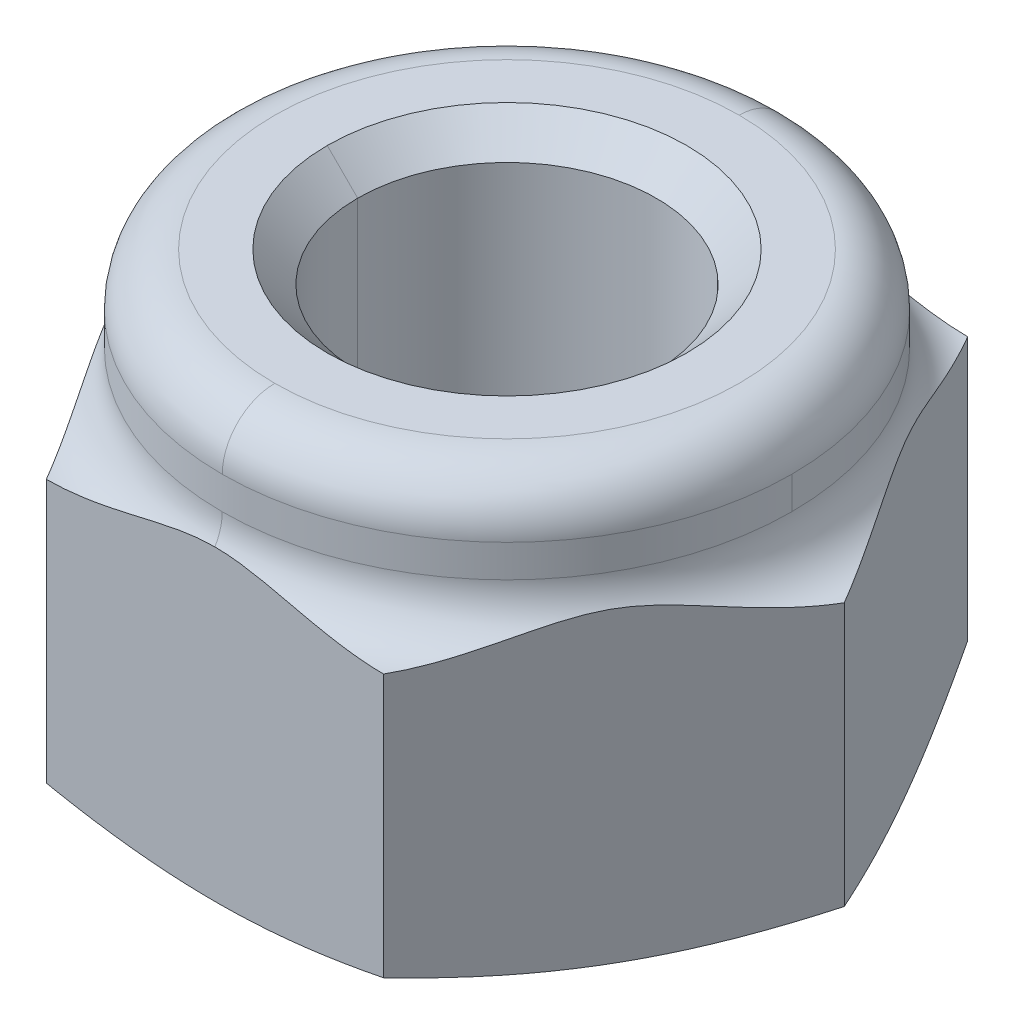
ISO-10303-21;
HEADER;
FILE_DESCRIPTION(('STEP AP214'),'2;1');
FILE_NAME('part.step','',(''),(''),'','','');
FILE_SCHEMA(('AUTOMOTIVE_DESIGN { 1 0 10303 214 1 1 1 1 }'));
ENDSEC;
DATA;
#1=APPLICATION_CONTEXT('core data for automotive mechanical design processes');
#2=APPLICATION_PROTOCOL_DEFINITION('international standard','automotive_design',2000,#1);
#3=PRODUCT_CONTEXT('',#1,'mechanical');
#4=PRODUCT('Part','Part','',(#3));
#5=PRODUCT_RELATED_PRODUCT_CATEGORY('part','',(#4));
#6=PRODUCT_DEFINITION_FORMATION('','',#4);
#7=PRODUCT_DEFINITION_CONTEXT('part definition',#1,'design');
#8=PRODUCT_DEFINITION('design','',#6,#7);
#9=PRODUCT_DEFINITION_SHAPE('','',#8);
#10=(LENGTH_UNIT() NAMED_UNIT(*) SI_UNIT(.MILLI.,.METRE.));
#11=(NAMED_UNIT(*) PLANE_ANGLE_UNIT() SI_UNIT($,.RADIAN.));
#12=(NAMED_UNIT(*) SI_UNIT($,.STERADIAN.) SOLID_ANGLE_UNIT());
#13=UNCERTAINTY_MEASURE_WITH_UNIT(LENGTH_MEASURE(1.E-05),#10,'distance_accuracy_value','');
#14=(GEOMETRIC_REPRESENTATION_CONTEXT(3) GLOBAL_UNCERTAINTY_ASSIGNED_CONTEXT((#13)) GLOBAL_UNIT_ASSIGNED_CONTEXT((#10,
#11,#12)) REPRESENTATION_CONTEXT('',''));
#15=CARTESIAN_POINT('',(0.,0.,0.));
#16=DIRECTION('',(0.,0.,1.));
#17=DIRECTION('',(1.,0.,0.));
#18=AXIS2_PLACEMENT_3D('',#15,#16,#17);
#19=CARTESIAN_POINT('',(0.,0.33828125,0.));
#20=DIRECTION('',(0.,-1.,0.));
#21=DIRECTION('',(1.,0.,0.));
#22=AXIS2_PLACEMENT_3D('',#19,#20,#21);
#23=CONICAL_SURFACE('',#22,3.66171875,0.785398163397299);
#24=CARTESIAN_POINT('',(0.,0.,0.));
#25=DIRECTION('',(0.,1.,0.));
#26=DIRECTION('',(-1.,0.,0.));
#27=AXIS2_PLACEMENT_3D('',#24,#25,#26);
#28=CIRCLE('',#27,4.);
#29=CARTESIAN_POINT('',(-4.,0.,0.));
#30=VERTEX_POINT('',#29);
#31=CARTESIAN_POINT('',(4.,0.,0.));
#32=VERTEX_POINT('',#31);
#33=EDGE_CURVE('E257',#30,#32,#28,.T.);
#34=ORIENTED_EDGE('',*,*,#33,.F.);
#35=DIRECTION('',(0.707106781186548,0.707106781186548,0.));
#36=VECTOR('',#35,1.);
#37=CARTESIAN_POINT('',(-4.,0.,0.));
#38=LINE('',#37,#36);
#39=CARTESIAN_POINT('',(-3.3234375,0.6765625,0.));
#40=VERTEX_POINT('',#39);
#41=EDGE_CURVE('E27',#30,#40,#38,.T.);
#42=ORIENTED_EDGE('',*,*,#41,.T.);
#43=CARTESIAN_POINT('',(0.,0.6765625,0.));
#44=DIRECTION('',(0.,1.,0.));
#45=DIRECTION('',(-1.,0.,0.));
#46=AXIS2_PLACEMENT_3D('',#43,#44,#45);
#47=CIRCLE('',#46,3.3234375);
#48=CARTESIAN_POINT('',(3.3234375,0.6765625,0.));
#49=VERTEX_POINT('',#48);
#50=EDGE_CURVE('E554',#40,#49,#47,.T.);
#51=ORIENTED_EDGE('',*,*,#50,.T.);
#52=DIRECTION('',(0.707106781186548,-0.707106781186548,0.));
#53=VECTOR('',#52,1.);
#54=CARTESIAN_POINT('',(3.3234375,0.6765625,0.));
#55=LINE('',#54,#53);
#56=EDGE_CURVE('E11',#49,#32,#55,.T.);
#57=ORIENTED_EDGE('',*,*,#56,.T.);
#58=EDGE_LOOP('',(#34,#42,#51,#57));
#59=FACE_BOUND('',#58,.T.);
#60=ADVANCED_FACE('F16',(#59),#23,.F.);
#61=CARTESIAN_POINT('',(0.,0.33828125,0.));
#62=DIRECTION('',(0.,-1.,0.));
#63=DIRECTION('',(1.,0.,0.));
#64=AXIS2_PLACEMENT_3D('',#61,#62,#63);
#65=CONICAL_SURFACE('',#64,3.66171875,0.785398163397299);
#66=CARTESIAN_POINT('',(0.,0.6765625,0.));
#67=DIRECTION('',(0.,1.,0.));
#68=DIRECTION('',(1.,0.,0.));
#69=AXIS2_PLACEMENT_3D('',#66,#67,#68);
#70=CIRCLE('',#69,3.3234375);
#71=EDGE_CURVE('E542',#49,#40,#70,.T.);
#72=ORIENTED_EDGE('',*,*,#71,.T.);
#73=ORIENTED_EDGE('',*,*,#41,.F.);
#74=CARTESIAN_POINT('',(0.,0.,0.));
#75=DIRECTION('',(0.,1.,0.));
#76=DIRECTION('',(1.,0.,0.));
#77=AXIS2_PLACEMENT_3D('',#74,#75,#76);
#78=CIRCLE('',#77,4.);
#79=EDGE_CURVE('E225',#32,#30,#78,.T.);
#80=ORIENTED_EDGE('',*,*,#79,.F.);
#81=ORIENTED_EDGE('',*,*,#56,.F.);
#82=EDGE_LOOP('',(#72,#73,#80,#81));
#83=FACE_BOUND('',#82,.T.);
#84=ADVANCED_FACE('F518',(#83),#65,.F.);
#85=CARTESIAN_POINT('',(0.,0.,0.));
#86=DIRECTION('',(0.,1.,0.));
#87=DIRECTION('',(1.,0.,0.));
#88=AXIS2_PLACEMENT_3D('',#85,#86,#87);
#89=PLANE('',#88);
#90=ORIENTED_EDGE('',*,*,#79,.T.);
#91=ORIENTED_EDGE('',*,*,#33,.T.);
#92=EDGE_LOOP('',(#90,#91));
#93=FACE_BOUND('',#92,.T.);
#94=CARTESIAN_POINT('',(0.,0.,0.));
#95=DIRECTION('',(0.,-1.,0.));
#96=DIRECTION('',(1.,0.,0.));
#97=AXIS2_PLACEMENT_3D('',#94,#95,#96);
#98=CIRCLE('',#97,6.056499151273);
#99=CARTESIAN_POINT('',(6.056499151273,0.,0.));
#100=VERTEX_POINT('',#99);
#101=CARTESIAN_POINT('',(-6.056499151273,0.,0.));
#102=VERTEX_POINT('',#101);
#103=EDGE_CURVE('E252',#100,#102,#98,.T.);
#104=ORIENTED_EDGE('',*,*,#103,.T.);
#105=CARTESIAN_POINT('',(0.,0.,0.));
#106=DIRECTION('',(0.,-1.,0.));
#107=DIRECTION('',(-1.,0.,0.));
#108=AXIS2_PLACEMENT_3D('',#105,#106,#107);
#109=CIRCLE('',#108,6.056499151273);
#110=EDGE_CURVE('E222',#102,#100,#109,.T.);
#111=ORIENTED_EDGE('',*,*,#110,.T.);
#112=EDGE_LOOP('',(#104,#111));
#113=FACE_BOUND('',#112,.T.);
#114=ADVANCED_FACE('F516',(#93,#113),#89,.F.);
#115=CARTESIAN_POINT('',(0.,0.2927272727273,0.));
#116=DIRECTION('',(0.,1.,0.));
#117=DIRECTION('',(1.,0.,0.));
#118=AXIS2_PLACEMENT_3D('',#115,#116,#117);
#119=CONICAL_SURFACE('',#118,6.781024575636,1.18682389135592);
#120=ORIENTED_EDGE('',*,*,#110,.F.);
#121=DIRECTION('',(-0.927183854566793,0.374606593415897,0.));
#122=VECTOR('',#121,1.);
#123=CARTESIAN_POINT('',(-6.056499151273,0.,0.));
#124=LINE('',#123,#122);
#125=CARTESIAN_POINT('',(-7.50555,0.5854545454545,0.));
#126=VERTEX_POINT('',#125);
#127=EDGE_CURVE('E256',#102,#126,#124,.T.);
#128=ORIENTED_EDGE('',*,*,#127,.T.);
#129=CARTESIAN_POINT('',(-7.50554999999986,0.585454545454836,0.));
#130=CARTESIAN_POINT('',(-7.44919035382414,0.562684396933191,-0.0976157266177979));
#131=CARTESIAN_POINT('',(-7.3927394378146,0.54064550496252,-0.195351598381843));
#132=CARTESIAN_POINT('',(-7.28060472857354,0.498508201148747,-0.389474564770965));
#133=CARTESIAN_POINT('',(-7.22492351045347,0.478383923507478,-0.485857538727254));
#134=CARTESIAN_POINT('',(-7.11422124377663,0.440073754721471,-0.677512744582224));
#135=CARTESIAN_POINT('',(-7.05920203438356,0.421864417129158,-0.772781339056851));
#136=CARTESIAN_POINT('',(-6.94968833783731,0.387380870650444,-0.962457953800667));
#137=CARTESIAN_POINT('',(-6.89519518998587,0.371086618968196,-1.05686309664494));
#138=CARTESIAN_POINT('',(-6.7865753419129,0.340432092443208,-1.24508044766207));
#139=CARTESIAN_POINT('',(-6.73244958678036,0.326056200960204,-1.3388906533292));
#140=CARTESIAN_POINT('',(-6.62434502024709,0.299224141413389,-1.52617771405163));
#141=CARTESIAN_POINT('',(-6.57036701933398,0.28675792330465,-1.61965359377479));
#142=CARTESIAN_POINT('',(-6.4659577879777,0.26453229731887,-1.80043529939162));
#143=CARTESIAN_POINT('',(-6.41553410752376,0.254646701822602,-1.88772994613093));
#144=CARTESIAN_POINT('',(-6.31486148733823,0.236684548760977,-2.06215068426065));
#145=CARTESIAN_POINT('',(-6.26461263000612,0.228601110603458,-2.14927611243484));
#146=CARTESIAN_POINT('',(-6.16405737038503,0.214230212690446,-2.32364385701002));
#147=CARTESIAN_POINT('',(-6.11375096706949,0.207942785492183,-2.41088617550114));
#148=CARTESIAN_POINT('',(-6.01055348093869,0.196910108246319,-2.58967924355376));
#149=CARTESIAN_POINT('',(-5.95765629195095,0.19225529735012,-2.68123207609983));
#150=CARTESIAN_POINT('',(-5.85217740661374,0.185026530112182,-2.86375778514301));
#151=CARTESIAN_POINT('',(-5.79959605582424,0.182438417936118,-2.9547302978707));
#152=CARTESIAN_POINT('',(-5.69455965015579,0.179340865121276,-3.13655244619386));
#153=CARTESIAN_POINT('',(-5.64210454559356,0.178827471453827,-3.22740198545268));
#154=CARTESIAN_POINT('',(-5.53961253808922,0.179823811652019,-3.40488290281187));
#155=CARTESIAN_POINT('',(-5.48957600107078,0.181241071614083,-3.49151503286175));
#156=CARTESIAN_POINT('',(-5.38958058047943,0.185929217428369,-3.66464451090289));
#157=CARTESIAN_POINT('',(-5.33962167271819,0.189198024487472,-3.75114190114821));
#158=CARTESIAN_POINT('',(-5.23959210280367,0.19758491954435,-3.92437062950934));
#159=CARTESIAN_POINT('',(-5.18952162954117,0.202709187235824,-4.01110177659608));
#160=CARTESIAN_POINT('',(-5.08934627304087,0.214762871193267,-4.18459815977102));
#161=CARTESIAN_POINT('',(-5.03924145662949,0.221695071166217,-4.27136324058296));
#162=CARTESIAN_POINT('',(-4.93893367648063,0.237354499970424,-4.44511237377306));
#163=CARTESIAN_POINT('',(-4.88873105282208,0.246088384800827,-4.53209602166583));
#164=CARTESIAN_POINT('',(-4.7880461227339,0.265345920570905,-4.70659512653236));
#165=CARTESIAN_POINT('',(-4.73756460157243,0.275882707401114,-4.79410958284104));
#166=CARTESIAN_POINT('',(-4.63610015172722,0.298728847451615,-4.96992487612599));
#167=CARTESIAN_POINT('',(-4.58511785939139,0.311056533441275,-5.05822369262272));
#168=CARTESIAN_POINT('',(-4.48293830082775,0.337403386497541,-5.23515707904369));
#169=CARTESIAN_POINT('',(-4.43174156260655,0.35143219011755,-5.3237905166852));
#170=CARTESIAN_POINT('',(-4.32902275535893,0.381179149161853,-5.50164917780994));
#171=CARTESIAN_POINT('',(-4.27750179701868,0.39691110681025,-5.59087273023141));
#172=CARTESIAN_POINT('',(-4.17400991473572,0.430059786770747,-5.77013694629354));
#173=CARTESIAN_POINT('',(-4.12204055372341,0.447493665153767,-5.86017533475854));
#174=CARTESIAN_POINT('',(-4.01752735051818,0.484043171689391,-6.04127038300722));
#175=CARTESIAN_POINT('',(-3.96498537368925,0.503178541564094,-6.13232412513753));
#176=CARTESIAN_POINT('',(-3.85920143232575,0.5431290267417,-6.315627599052));
#177=CARTESIAN_POINT('',(-3.80596138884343,0.563965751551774,-6.40787373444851));
#178=CARTESIAN_POINT('',(-3.75277499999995,0.585454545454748,-6.49999696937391));
#179=B_SPLINE_CURVE_WITH_KNOTS('',3,(#129,#130,#131,#132,#133,#134,#135,#136,#137,#138,#139,
#140,#141,#142,#143,#144,#145,#146,#147,#148,#149,#150,#151,#152,#153,#154,#155,#156,#157,#158,
#159,#160,#161,#162,#163,#164,#165,#166,#167,#168,#169,#170,#171,#172,#173,#174,#175,#176,#177,
#178),.UNSPECIFIED.,.F.,.F.,(4,2,2,2,2,2,2,2,2,2,2,2,2,2,2,2,2,2,2,2,2,2,2,2,4),(0.,
0.344983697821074,0.684318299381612,1.01883950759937,1.3494701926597,1.67721951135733,
2.00317989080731,2.30704942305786,2.60973812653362,2.9124323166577,3.22992714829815,
3.5452281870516,3.85992818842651,4.16007292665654,4.45988134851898,4.76069762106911,
5.06197982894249,5.36439566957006,5.6691168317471,5.97721159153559,6.28714124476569,
6.59980307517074,6.91602790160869,7.23657815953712,7.56214745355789),.UNSPECIFIED.);
#180=CARTESIAN_POINT('',(-3.752775,0.5854545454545,-6.499996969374));
#181=VERTEX_POINT('',#180);
#182=EDGE_CURVE('E397',#126,#181,#179,.T.);
#183=ORIENTED_EDGE('',*,*,#182,.T.);
#184=CARTESIAN_POINT('',(-3.75277499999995,0.585454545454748,-6.49999696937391));
#185=CARTESIAN_POINT('',(-3.6400574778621,0.562684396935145,-6.49999594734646));
#186=CARTESIAN_POINT('',(-3.52719027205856,0.540645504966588,-6.49997595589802));
#187=CARTESIAN_POINT('',(-3.30300749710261,0.498508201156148,-6.49992593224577));
#188=CARTESIAN_POINT('',(-3.19169678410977,0.478383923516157,-6.49989606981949));
#189=CARTESIAN_POINT('',(-2.97036737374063,0.440073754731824,-6.49985269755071));
#190=CARTESIAN_POINT('',(-2.8603527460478,0.421864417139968,-6.49983896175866));
#191=CARTESIAN_POINT('',(-2.64133113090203,0.387380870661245,-6.49983562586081));
#192=CARTESIAN_POINT('',(-2.53232730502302,0.371086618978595,-6.49984574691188));
#193=CARTESIAN_POINT('',(-2.3150163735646,0.340432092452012,-6.49988687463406));
#194=CARTESIAN_POINT('',(-2.20671147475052,0.326056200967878,-6.49991769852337));
#195=CARTESIAN_POINT('',(-1.99046383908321,0.29922414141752,-6.49993992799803));
#196=CARTESIAN_POINT('',(-1.88252235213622,0.28675792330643,-6.49993154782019));
#197=CARTESIAN_POINT('',(-1.67375618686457,0.264532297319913,-6.49990135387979));
#198=CARTESIAN_POINT('',(-1.57294496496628,0.25464670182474,-6.49988048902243));
#199=CARTESIAN_POINT('',(-1.37155586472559,0.236684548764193,-6.49990581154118));
#200=CARTESIAN_POINT('',(-1.270978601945,0.228601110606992,-6.49995173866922));
#201=CARTESIAN_POINT('',(-1.06969407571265,0.214230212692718,-6.50005220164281));
#202=CARTESIAN_POINT('',(-0.968986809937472,0.207942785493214,-6.5001067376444));
#203=CARTESIAN_POINT('',(-0.762548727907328,0.196910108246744,-6.50013162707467));
#204=CARTESIAN_POINT('',(-0.656813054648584,0.192255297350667,-6.50009773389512));
#205=CARTESIAN_POINT('',(-0.446001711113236,0.185026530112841,-6.50001319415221));
#206=CARTESIAN_POINT('',(-0.340926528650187,0.182438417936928,-6.49996266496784));
#207=CARTESIAN_POINT('',(-0.130945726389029,0.179340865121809,-6.49990954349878));
#208=CARTESIAN_POINT('',(-0.0260401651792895,0.178827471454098,-6.49990686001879));
#209=CARTESIAN_POINT('',(0.178908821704,0.179823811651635,-6.49988663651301));
#210=CARTESIAN_POINT('',(0.278952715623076,0.181241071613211,-6.49986978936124));
#211=CARTESIAN_POINT('',(0.478884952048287,0.185929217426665,-6.49983595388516));
#212=CARTESIAN_POINT('',(0.578773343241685,0.189198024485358,-6.4998189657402));
#213=CARTESIAN_POINT('',(0.778808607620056,0.197584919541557,-6.49980518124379));
#214=CARTESIAN_POINT('',(0.878955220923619,0.2027091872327,-6.49980845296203));
#215=CARTESIAN_POINT('',(1.07929517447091,0.214762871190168,-6.49980224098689));
#216=CARTESIAN_POINT('',(1.17948834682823,0.221695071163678,-6.49979273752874));
#217=CARTESIAN_POINT('',(1.38011340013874,0.237354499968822,-6.499798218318));
#218=CARTESIAN_POINT('',(1.48054476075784,0.246088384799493,-6.49981329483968));
#219=CARTESIAN_POINT('',(1.68200788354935,0.265345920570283,-6.49986714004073));
#220=CARTESIAN_POINT('',(1.78303838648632,0.275882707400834,-6.49990608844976));
#221=CARTESIAN_POINT('',(1.98603112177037,0.298728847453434,-6.49994294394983));
#222=CARTESIAN_POINT('',(2.08799128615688,0.31105653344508,-6.49994039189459));
#223=CARTESIAN_POINT('',(2.29230987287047,0.337403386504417,-6.49991699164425));
#224=CARTESIAN_POINT('',(2.39466705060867,0.35143219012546,-6.49989603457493));
#225=CARTESIAN_POINT('',(2.60005657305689,0.381179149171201,-6.49986826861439));
#226=CARTESIAN_POINT('',(2.70308691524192,0.396911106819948,-6.4998615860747));
#227=CARTESIAN_POINT('',(2.91008022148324,0.430059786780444,-6.49986709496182));
#228=CARTESIAN_POINT('',(3.01404043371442,0.447493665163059,-6.49987950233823));
#229=CARTESIAN_POINT('',(3.22312994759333,0.484043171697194,-6.49991593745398));
#230=CARTESIAN_POINT('',(3.32825578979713,0.503178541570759,-6.49994012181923));
#231=CARTESIAN_POINT('',(3.53989322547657,0.543129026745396,-6.49998027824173));
#232=CARTESIAN_POINT('',(3.64640074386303,0.563965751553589,-6.49999611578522));
#233=CARTESIAN_POINT('',(3.75277499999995,0.585454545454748,-6.49999696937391));
#234=B_SPLINE_CURVE_WITH_KNOTS('',3,(#184,#185,#186,#187,#188,#189,#190,#191,#192,#193,#194,
#195,#196,#197,#198,#199,#200,#201,#202,#203,#204,#205,#206,#207,#208,#209,#210,#211,#212,#213,
#214,#215,#216,#217,#218,#219,#220,#221,#222,#223,#224,#225,#226,#227,#228,#229,#230,#231,#232,
#233),.UNSPECIFIED.,.F.,.F.,(4,2,2,2,2,2,2,2,2,2,2,2,2,2,2,2,2,2,2,2,2,2,2,2,4),(0.,
0.344983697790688,0.684318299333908,1.01883950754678,1.34947019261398,1.67721951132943,
2.00317989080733,2.3070494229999,2.60973812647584,2.91243231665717,3.2299271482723,
3.5452281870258,3.85992818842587,4.16007292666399,4.4598813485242,4.7606976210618,
5.06197982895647,5.36439566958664,5.66911683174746,5.97721159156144,6.28714124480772,
6.59980307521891,6.9160279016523,7.23657815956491,7.56214745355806),.UNSPECIFIED.);
#235=CARTESIAN_POINT('',(3.752775,0.5854545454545,-6.499996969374));
#236=VERTEX_POINT('',#235);
#237=EDGE_CURVE('E1104',#181,#236,#234,.T.);
#238=ORIENTED_EDGE('',*,*,#237,.T.);
#239=CARTESIAN_POINT('',(3.75277499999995,0.585454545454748,-6.49999696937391));
#240=CARTESIAN_POINT('',(3.80913287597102,0.56268439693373,-6.40238022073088));
#241=CARTESIAN_POINT('',(3.86554916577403,0.540645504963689,-6.3046243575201));
#242=CARTESIAN_POINT('',(3.97759723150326,0.49850820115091,-6.11045136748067));
#243=CARTESIAN_POINT('',(4.03322672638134,0.478383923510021,-6.01403853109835));
#244=CARTESIAN_POINT('',(4.14385387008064,0.440073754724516,-5.82233995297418));
#245=CARTESIAN_POINT('',(4.19884928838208,0.421864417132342,-5.72705762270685));
#246=CARTESIAN_POINT('',(4.30835720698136,0.387380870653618,-5.53737767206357));
#247=CARTESIAN_POINT('',(4.36286788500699,0.371086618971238,-5.44298265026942));
#248=CARTESIAN_POINT('',(4.47155896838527,0.340432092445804,-5.25480642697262));
#249=CARTESIAN_POINT('',(4.52573811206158,0.326056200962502,-5.1610270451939));
#250=CARTESIAN_POINT('',(4.63388118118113,0.299224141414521,-4.97376221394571));
#251=CARTESIAN_POINT('',(4.68784466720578,0.28675792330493,-4.88027795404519));
#252=CARTESIAN_POINT('',(4.79220160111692,0.264532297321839,-4.69946605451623));
#253=CARTESIAN_POINT('',(4.8425891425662,0.254646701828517,-4.61215054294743));
#254=CARTESIAN_POINT('',(4.9433056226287,0.236684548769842,-4.43775512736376));
#255=CARTESIAN_POINT('',(4.9936340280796,0.228601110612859,-4.350675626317));
#256=CARTESIAN_POINT('',(5.09436329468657,0.214230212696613,-4.17640834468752));
#257=CARTESIAN_POINT('',(5.14476415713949,0.207942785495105,-4.08922056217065));
#258=CARTESIAN_POINT('',(5.24800475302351,0.196910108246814,-3.91045238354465));
#259=CARTESIAN_POINT('',(5.30084323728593,0.192255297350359,-3.8188656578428));
#260=CARTESIAN_POINT('',(5.40617569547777,0.185026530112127,-3.63625540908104));
#261=CARTESIAN_POINT('',(5.45866952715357,0.182438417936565,-3.54523236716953));
#262=CARTESIAN_POINT('',(5.56361392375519,0.179340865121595,-3.36335709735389));
#263=CARTESIAN_POINT('',(5.61606438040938,0.178827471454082,-3.27250487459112));
#264=CARTESIAN_POINT('',(5.71852135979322,0.179823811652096,-3.09500373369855));
#265=CARTESIAN_POINT('',(5.76852871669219,0.181241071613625,-3.00835475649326));
#266=CARTESIAN_POINT('',(5.86846553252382,0.185929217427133,-2.83519144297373));
#267=CARTESIAN_POINT('',(5.91839501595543,0.189198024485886,-2.74867706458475));
#268=CARTESIAN_POINT('',(6.01840071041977,0.197584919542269,-2.57543455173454));
#269=CARTESIAN_POINT('',(6.0684768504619,0.202709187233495,-2.48870667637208));
#270=CARTESIAN_POINT('',(6.16864144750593,0.214762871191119,-2.31520408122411));
#271=CARTESIAN_POINT('',(6.21872980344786,0.221695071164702,-2.22842949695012));
#272=CARTESIAN_POINT('',(6.31904707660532,0.237354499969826,-2.0546858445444));
#273=CARTESIAN_POINT('',(6.36927581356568,0.246088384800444,-1.96771727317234));
#274=CARTESIAN_POINT('',(6.47005400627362,0.265345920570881,-1.79327201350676));
#275=CARTESIAN_POINT('',(6.52060298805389,0.275882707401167,-1.70579650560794));
#276=CARTESIAN_POINT('',(6.62213127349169,0.298728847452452,-1.53001806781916));
#277=CARTESIAN_POINT('',(6.67310914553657,0.311056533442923,-1.44171669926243));
#278=CARTESIAN_POINT('',(6.77524817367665,0.337403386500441,-1.26475991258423));
#279=CARTESIAN_POINT('',(6.82640861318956,0.351432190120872,-1.17610551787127));
#280=CARTESIAN_POINT('',(6.92907932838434,0.381179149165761,-0.998219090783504));
#281=CARTESIAN_POINT('',(6.98058871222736,0.396911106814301,-0.908988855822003));
#282=CARTESIAN_POINT('',(7.08409013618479,0.430059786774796,-0.729730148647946));
#283=CARTESIAN_POINT('',(7.1360809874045,0.447493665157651,-0.639704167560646));
#284=CARTESIAN_POINT('',(7.24065729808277,0.484043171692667,-0.458645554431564));
#285=CARTESIAN_POINT('',(7.2932411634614,0.503178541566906,-0.367615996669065));
#286=CARTESIAN_POINT('',(7.3990946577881,0.543129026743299,-0.18435267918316));
#287=CARTESIAN_POINT('',(7.45236213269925,0.563965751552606,-0.0921223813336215));
#288=CARTESIAN_POINT('',(7.50554999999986,0.585454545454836,0.));
#289=B_SPLINE_CURVE_WITH_KNOTS('',3,(#239,#240,#241,#242,#243,#244,#245,#246,#247,#248,#249,
#250,#251,#252,#253,#254,#255,#256,#257,#258,#259,#260,#261,#262,#263,#264,#265,#266,#267,#268,
#269,#270,#271,#272,#273,#274,#275,#276,#277,#278,#279,#280,#281,#282,#283,#284,#285,#286,#287,
#288),.UNSPECIFIED.,.F.,.F.,(4,2,2,2,2,2,2,2,2,2,2,2,2,2,2,2,2,2,2,2,2,2,2,2,4),(0.,
0.344983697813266,0.684318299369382,1.01883950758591,1.34947019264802,1.67721951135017,
2.00317989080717,2.30704942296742,2.60973812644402,2.91243231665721,3.22992714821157,
3.54522818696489,3.85992818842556,4.16007292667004,4.45988134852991,4.76069762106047,
5.06197982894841,5.36439566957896,5.66911683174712,5.97721159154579,6.28714124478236,
6.59980307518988,6.91602790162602,7.23657815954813,7.56214745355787),.UNSPECIFIED.);
#290=CARTESIAN_POINT('',(7.50555,0.5854545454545,0.));
#291=VERTEX_POINT('',#290);
#292=EDGE_CURVE('E513',#236,#291,#289,.T.);
#293=ORIENTED_EDGE('',*,*,#292,.T.);
#294=DIRECTION('',(-0.927183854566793,-0.374606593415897,0.));
#295=VECTOR('',#294,1.);
#296=CARTESIAN_POINT('',(7.50555,0.5854545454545,0.));
#297=LINE('',#296,#295);
#298=EDGE_CURVE('E226',#291,#100,#297,.T.);
#299=ORIENTED_EDGE('',*,*,#298,.T.);
#300=EDGE_LOOP('',(#120,#128,#183,#238,#293,#299));
#301=FACE_BOUND('',#300,.T.);
#302=ADVANCED_FACE('F285',(#301),#119,.T.);
#303=CARTESIAN_POINT('',(0.,0.2927272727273,0.));
#304=DIRECTION('',(0.,1.,0.));
#305=DIRECTION('',(1.,0.,0.));
#306=AXIS2_PLACEMENT_3D('',#303,#304,#305);
#307=CONICAL_SURFACE('',#306,6.781024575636,1.18682389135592);
#308=CARTESIAN_POINT('',(7.50554999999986,0.585454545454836,0.));
#309=CARTESIAN_POINT('',(7.44919035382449,0.562684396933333,0.0976157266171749));
#310=CARTESIAN_POINT('',(7.39273943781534,0.54064550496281,0.195351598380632));
#311=CARTESIAN_POINT('',(7.28060472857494,0.498508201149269,0.389474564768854));
#312=CARTESIAN_POINT('',(7.22492351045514,0.478383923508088,0.485857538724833));
#313=CARTESIAN_POINT('',(7.11422124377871,0.440073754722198,0.677512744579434));
#314=CARTESIAN_POINT('',(7.05920203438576,0.421864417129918,0.772781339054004));
#315=CARTESIAN_POINT('',(6.94968833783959,0.387380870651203,0.962457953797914));
#316=CARTESIAN_POINT('',(6.8951951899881,0.371086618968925,1.05686309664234));
#317=CARTESIAN_POINT('',(6.78657534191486,0.340432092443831,1.24508044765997));
#318=CARTESIAN_POINT('',(6.7324495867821,0.326056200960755,1.33889065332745));
#319=CARTESIAN_POINT('',(6.62434502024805,0.299224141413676,1.52617771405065));
#320=CARTESIAN_POINT('',(6.57036701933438,0.286757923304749,1.61965359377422));
#321=CARTESIAN_POINT('',(6.46595778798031,0.264532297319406,1.80043529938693));
#322=CARTESIAN_POINT('',(6.41553410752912,0.254646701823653,1.88772994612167));
#323=CARTESIAN_POINT('',(6.31486148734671,0.236684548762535,2.06215068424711));
#324=CARTESIAN_POINT('',(6.26461263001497,0.228601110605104,2.14927611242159));
#325=CARTESIAN_POINT('',(6.1640573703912,0.214230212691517,2.32364385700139));
#326=CARTESIAN_POINT('',(6.1137509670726,0.207942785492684,2.41088617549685));
#327=CARTESIAN_POINT('',(6.01055348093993,0.196910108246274,2.58967924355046));
#328=CARTESIAN_POINT('',(5.95765629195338,0.192255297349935,2.68123207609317));
#329=CARTESIAN_POINT('',(5.85217740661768,0.18502653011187,2.86375778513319));
#330=CARTESIAN_POINT('',(5.79959605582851,0.182438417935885,2.95473029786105));
#331=CARTESIAN_POINT('',(5.69455965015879,0.17934086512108,3.13655244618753));
#332=CARTESIAN_POINT('',(5.64210454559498,0.17882747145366,3.22740198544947));
#333=CARTESIAN_POINT('',(5.53961253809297,0.179823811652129,3.40488290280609));
#334=CARTESIAN_POINT('',(5.48957600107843,0.181241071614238,3.49151503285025));
#335=CARTESIAN_POINT('',(5.38958058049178,0.18592921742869,3.66464451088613));
#336=CARTESIAN_POINT('',(5.33962167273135,0.189198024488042,3.75114190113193));
#337=CARTESIAN_POINT('',(5.23959210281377,0.197584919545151,3.92437062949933));
#338=CARTESIAN_POINT('',(5.18952162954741,0.202709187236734,4.01110177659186));
#339=CARTESIAN_POINT('',(5.08934627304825,0.214762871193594,4.18459815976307));
#340=CARTESIAN_POINT('',(5.03924145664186,0.221695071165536,4.27136324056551));
#341=CARTESIAN_POINT('',(4.93893367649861,0.237354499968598,4.44511237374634));
#342=CARTESIAN_POINT('',(4.88873105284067,0.246088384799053,4.53209602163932));
#343=CARTESIAN_POINT('',(4.7880461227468,0.265345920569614,4.70659512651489));
#344=CARTESIAN_POINT('',(4.73756460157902,0.275882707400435,4.79410958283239));
#345=CARTESIAN_POINT('',(4.63610015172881,0.29872884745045,4.96992487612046));
#346=CARTESIAN_POINT('',(4.58511785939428,0.311056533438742,5.05822369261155));
#347=CARTESIAN_POINT('',(4.48293830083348,0.337403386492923,5.23515707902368));
#348=CARTESIAN_POINT('',(4.43174156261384,0.351432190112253,5.32379051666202));
#349=CARTESIAN_POINT('',(4.3290227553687,0.381179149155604,5.50164917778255));
#350=CARTESIAN_POINT('',(4.27750179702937,0.396911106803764,5.590872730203));
#351=CARTESIAN_POINT('',(4.17400991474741,0.430059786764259,5.77013694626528));
#352=CARTESIAN_POINT('',(4.12204055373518,0.447493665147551,5.86017533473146));
#353=CARTESIAN_POINT('',(4.01752735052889,0.484043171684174,6.04127038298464));
#354=CARTESIAN_POINT('',(3.96498537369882,0.503178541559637,6.13232412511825));
#355=CARTESIAN_POINT('',(3.85920143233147,0.543129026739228,6.31562759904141));
#356=CARTESIAN_POINT('',(3.80596138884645,0.56396575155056,6.4078737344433));
#357=CARTESIAN_POINT('',(3.75277499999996,0.585454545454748,6.49999696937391));
#358=B_SPLINE_CURVE_WITH_KNOTS('',3,(#308,#309,#310,#311,#312,#313,#314,#315,#316,#317,#318,
#319,#320,#321,#322,#323,#324,#325,#326,#327,#328,#329,#330,#331,#332,#333,#334,#335,#336,#337,
#338,#339,#340,#341,#342,#343,#344,#345,#346,#347,#348,#349,#350,#351,#352,#353,#354,#355,#356,
#357),.UNSPECIFIED.,.F.,.F.,(4,2,2,2,2,2,2,2,2,2,2,2,2,2,2,2,2,2,2,2,2,2,2,2,4),(0.,
0.344983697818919,0.684318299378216,1.01883950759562,1.34947019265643,1.67721951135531,
2.00317989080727,2.30704942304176,2.6097381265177,2.91243231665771,3.2299271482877,
3.54522818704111,3.85992818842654,4.16007292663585,4.45988134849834,4.76069762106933,
5.06197982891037,5.36439566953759,5.66911683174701,5.9772115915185,6.28714124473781,
6.59980307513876,6.91602790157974,7.23657815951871,7.5621474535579),.UNSPECIFIED.);
#359=CARTESIAN_POINT('',(3.752775,0.5854545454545,6.499996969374));
#360=VERTEX_POINT('',#359);
#361=EDGE_CURVE('E309',#291,#360,#358,.T.);
#362=ORIENTED_EDGE('',*,*,#361,.T.);
#363=CARTESIAN_POINT('',(3.75277499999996,0.585454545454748,6.49999696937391));
#364=CARTESIAN_POINT('',(3.64005747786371,0.56268439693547,6.49999594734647));
#365=CARTESIAN_POINT('',(3.52719027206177,0.540645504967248,6.49997595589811));
#366=CARTESIAN_POINT('',(3.30300749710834,0.498508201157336,6.49992593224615));
#367=CARTESIAN_POINT('',(3.19169678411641,0.478383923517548,6.49989606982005));
#368=CARTESIAN_POINT('',(2.97036737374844,0.440073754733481,6.49985269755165));
#369=CARTESIAN_POINT('',(2.86035274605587,0.4218644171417,6.49983896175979));
#370=CARTESIAN_POINT('',(2.64133113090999,0.387380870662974,6.4998356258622));
#371=CARTESIAN_POINT('',(2.53232730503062,0.371086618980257,6.49984574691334));
#372=CARTESIAN_POINT('',(2.3150163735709,0.340432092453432,6.49988687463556));
#373=CARTESIAN_POINT('',(2.20671147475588,0.326056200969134,6.49991769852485));
#374=CARTESIAN_POINT('',(1.99046383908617,0.299224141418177,6.49993992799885));
#375=CARTESIAN_POINT('',(1.88252235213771,0.286757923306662,6.49993154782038));
#376=CARTESIAN_POINT('',(1.67375618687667,0.264532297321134,6.49990135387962));
#377=CARTESIAN_POINT('',(1.57294496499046,0.254646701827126,6.49988048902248));
#378=CARTESIAN_POINT('',(1.37155586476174,0.23668454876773,6.4999058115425));
#379=CARTESIAN_POINT('',(1.270978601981,0.228601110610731,6.4999517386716));
#380=CARTESIAN_POINT('',(1.06969407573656,0.214230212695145,6.50005220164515));
#381=CARTESIAN_POINT('',(0.968986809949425,0.207942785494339,6.50010673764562));
#382=CARTESIAN_POINT('',(0.762548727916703,0.196910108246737,6.50013162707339));
#383=CARTESIAN_POINT('',(0.65681305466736,0.192255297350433,6.50009773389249));
#384=CARTESIAN_POINT('',(0.446001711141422,0.185026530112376,6.50001319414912));
#385=CARTESIAN_POINT('',(0.340926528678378,0.182438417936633,6.49996266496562));
#386=CARTESIAN_POINT('',(0.130945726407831,0.179340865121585,6.499909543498));
#387=CARTESIAN_POINT('',(0.0260401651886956,0.178827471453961,6.49990686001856));
#388=CARTESIAN_POINT('',(-0.17890882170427,0.179823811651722,6.49988663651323));
#389=CARTESIAN_POINT('',(-0.278952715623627,0.18124107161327,6.49986978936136));
#390=CARTESIAN_POINT('',(-0.478884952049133,0.185929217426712,6.49983595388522));
#391=CARTESIAN_POINT('',(-0.578773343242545,0.189198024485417,6.49981896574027));
#392=CARTESIAN_POINT('',(-0.778808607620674,0.197584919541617,6.49980518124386));
#393=CARTESIAN_POINT('',(-0.878955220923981,0.202709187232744,6.49980845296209));
#394=CARTESIAN_POINT('',(-1.07929517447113,0.2147628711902,6.49980224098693));
#395=CARTESIAN_POINT('',(-1.17948834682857,0.221695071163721,6.49979273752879));
#396=CARTESIAN_POINT('',(-1.38011340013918,0.237354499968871,6.49979821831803));
#397=CARTESIAN_POINT('',(-1.48054476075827,0.246088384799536,6.49981329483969));
#398=CARTESIAN_POINT('',(-1.68200788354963,0.26534592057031,6.49986714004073));
#399=CARTESIAN_POINT('',(-1.78303838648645,0.275882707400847,6.49990608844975));
#400=CARTESIAN_POINT('',(-1.98603112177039,0.29872884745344,6.49994294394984));
#401=CARTESIAN_POINT('',(-2.08799128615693,0.311056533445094,6.49994039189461));
#402=CARTESIAN_POINT('',(-2.29230987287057,0.337403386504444,6.49991699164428));
#403=CARTESIAN_POINT('',(-2.39466705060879,0.351432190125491,6.49989603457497));
#404=CARTESIAN_POINT('',(-2.60005657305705,0.381179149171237,6.49986826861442));
#405=CARTESIAN_POINT('',(-2.70308691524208,0.396911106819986,6.49986158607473));
#406=CARTESIAN_POINT('',(-2.91008022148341,0.430059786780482,6.49986709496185));
#407=CARTESIAN_POINT('',(-3.01404043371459,0.447493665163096,6.49987950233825));
#408=CARTESIAN_POINT('',(-3.22312994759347,0.484043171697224,6.49991593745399));
#409=CARTESIAN_POINT('',(-3.32825578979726,0.503178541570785,6.49994012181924));
#410=CARTESIAN_POINT('',(-3.53989322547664,0.54312902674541,6.49998027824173));
#411=CARTESIAN_POINT('',(-3.64640074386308,0.563965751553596,6.49999611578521));
#412=CARTESIAN_POINT('',(-3.75277499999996,0.585454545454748,6.49999696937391));
#413=B_SPLINE_CURVE_WITH_KNOTS('',3,(#363,#364,#365,#366,#367,#368,#369,#370,#371,#372,#373,
#374,#375,#376,#377,#378,#379,#380,#381,#382,#383,#384,#385,#386,#387,#388,#389,#390,#391,#392,
#393,#394,#395,#396,#397,#398,#399,#400,#401,#402,#403,#404,#405,#406,#407,#408,#409,#410,#411,
#412),.UNSPECIFIED.,.F.,.F.,(4,2,2,2,2,2,2,2,2,2,2,2,2,2,2,2,2,2,2,2,2,2,2,2,4),(0.,
0.344983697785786,0.684318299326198,1.01883950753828,1.34947019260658,1.6772195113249,
2.0031798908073,2.30704942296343,2.60973812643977,2.91243231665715,3.22992714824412,
3.54522818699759,3.85992818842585,4.16007292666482,4.45988134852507,4.7606976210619,
5.06197982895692,5.36439566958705,5.66911683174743,5.97721159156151,6.28714124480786,
6.59980307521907,6.91602790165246,7.23657815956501,7.56214745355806),.UNSPECIFIED.);
#414=CARTESIAN_POINT('',(-3.752775,0.5854545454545,6.499996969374));
#415=VERTEX_POINT('',#414);
#416=EDGE_CURVE('E362',#360,#415,#413,.T.);
#417=ORIENTED_EDGE('',*,*,#416,.T.);
#418=CARTESIAN_POINT('',(-3.75277499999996,0.585454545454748,6.49999696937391));
#419=CARTESIAN_POINT('',(-3.80913287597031,0.562684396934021,6.40238022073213));
#420=CARTESIAN_POINT('',(-3.86554916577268,0.540645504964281,6.30462435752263));
#421=CARTESIAN_POINT('',(-3.97759723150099,0.498508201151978,6.11045136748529));
#422=CARTESIAN_POINT('',(-4.03322672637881,0.478383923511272,6.01403853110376));
#423=CARTESIAN_POINT('',(-4.14385387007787,0.440073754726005,5.82233995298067));
#424=CARTESIAN_POINT('',(-4.19884928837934,0.421864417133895,5.72705762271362));
#425=CARTESIAN_POINT('',(-4.30835720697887,0.387380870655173,5.53737767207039));
#426=CARTESIAN_POINT('',(-4.36286788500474,0.37108661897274,5.442982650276));
#427=CARTESIAN_POINT('',(-4.4715589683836,0.340432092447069,5.25480642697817));
#428=CARTESIAN_POINT('',(-4.52573811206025,0.326056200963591,5.16102704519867));
#429=CARTESIAN_POINT('',(-4.63388118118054,0.299224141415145,4.9737622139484));
#430=CARTESIAN_POINT('',(-4.68784466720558,0.286757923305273,4.88027795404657));
#431=CARTESIAN_POINT('',(-4.79220160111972,0.264532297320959,4.69946605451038));
#432=CARTESIAN_POINT('',(-4.84258914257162,0.254646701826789,4.61215054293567));
#433=CARTESIAN_POINT('',(-4.94330562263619,0.236684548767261,4.43775512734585));
#434=CARTESIAN_POINT('',(-4.99363402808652,0.228601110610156,4.35067562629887));
#435=CARTESIAN_POINT('',(-5.09436329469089,0.214230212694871,4.1764083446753));
#436=CARTESIAN_POINT('',(-5.14476415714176,0.207942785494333,4.08922056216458));
#437=CARTESIAN_POINT('',(-5.24800475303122,0.196910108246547,3.91045238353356));
#438=CARTESIAN_POINT('',(-5.3008432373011,0.192255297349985,3.81886565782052));
#439=CARTESIAN_POINT('',(-5.40617569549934,0.185026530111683,3.636255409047));
#440=CARTESIAN_POINT('',(-5.4586695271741,0.182438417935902,3.54523236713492));
#441=CARTESIAN_POINT('',(-5.56361392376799,0.17934086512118,3.36335709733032));
#442=CARTESIAN_POINT('',(-5.61606438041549,0.178827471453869,3.27250487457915));
#443=CARTESIAN_POINT('',(-5.71852135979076,0.179823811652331,3.09500373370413));
#444=CARTESIAN_POINT('',(-5.76852871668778,0.181241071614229,3.00835475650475));
#445=CARTESIAN_POINT('',(-5.86846553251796,0.185929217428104,2.83519144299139));
#446=CARTESIAN_POINT('',(-5.91839501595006,0.18919802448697,2.74867706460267));
#447=CARTESIAN_POINT('',(-6.01840071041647,0.197584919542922,2.5754345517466));
#448=CARTESIAN_POINT('',(-6.06847685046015,0.202709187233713,2.48870667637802));
#449=CARTESIAN_POINT('',(-6.16864144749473,0.214762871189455,2.31520408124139));
#450=CARTESIAN_POINT('',(-6.21872980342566,0.221695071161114,2.22842949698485));
#451=CARTESIAN_POINT('',(-6.31904707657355,0.237354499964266,2.05468584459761));
#452=CARTESIAN_POINT('',(-6.36927581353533,0.246088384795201,1.96771727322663));
#453=CARTESIAN_POINT('',(-6.47005400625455,0.265345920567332,1.79327201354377));
#454=CARTESIAN_POINT('',(-6.52060298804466,0.27588270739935,1.70579650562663));
#455=CARTESIAN_POINT('',(-6.62213127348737,0.298728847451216,1.53001806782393));
#456=CARTESIAN_POINT('',(-6.67310914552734,0.311056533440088,1.44171669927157));
#457=CARTESIAN_POINT('',(-6.77524817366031,0.337403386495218,1.26475991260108));
#458=CARTESIAN_POINT('',(-6.82640861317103,0.351432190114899,1.17610551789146));
#459=CARTESIAN_POINT('',(-6.92907932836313,0.381179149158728,0.998219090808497));
#460=CARTESIAN_POINT('',(-6.98058871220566,0.396911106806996,0.908988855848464));
#461=CARTESIAN_POINT('',(-7.08409013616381,0.430059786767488,0.729730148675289));
#462=CARTESIAN_POINT('',(-7.13608098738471,0.44749366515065,0.639704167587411));
#463=CARTESIAN_POINT('',(-7.24065729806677,0.484043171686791,0.458645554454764));
#464=CARTESIAN_POINT('',(-7.29324116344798,0.503178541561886,0.367615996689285));
#465=CARTESIAN_POINT('',(-7.39909465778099,0.543129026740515,0.184352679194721));
#466=CARTESIAN_POINT('',(-7.45236213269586,0.563965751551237,0.0921223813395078));
#467=CARTESIAN_POINT('',(-7.50554999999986,0.585454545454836,0.));
#468=B_SPLINE_CURVE_WITH_KNOTS('',3,(#418,#419,#420,#421,#422,#423,#424,#425,#426,#427,#428,
#429,#430,#431,#432,#433,#434,#435,#436,#437,#438,#439,#440,#441,#442,#443,#444,#445,#446,#447,
#448,#449,#450,#451,#452,#453,#454,#455,#456,#457,#458,#459,#460,#461,#462,#463,#464,#465,#466,
#467),.UNSPECIFIED.,.F.,.F.,(4,2,2,2,2,2,2,2,2,2,2,2,2,2,2,2,2,2,2,2,2,2,2,2,4),(0.,
0.344983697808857,0.68431829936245,1.01883950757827,1.34947019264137,1.67721951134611,
2.00317989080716,2.30704942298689,2.60973812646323,2.91243231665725,3.22992714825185,
3.54522818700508,3.85992818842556,4.16007292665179,4.45988134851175,4.76069762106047,
5.06197982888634,5.36439566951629,5.66911683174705,5.97721159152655,6.28714124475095,
6.59980307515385,6.9160279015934,7.23657815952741,7.5621474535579),.UNSPECIFIED.);
#469=EDGE_CURVE('E267',#415,#126,#468,.T.);
#470=ORIENTED_EDGE('',*,*,#469,.T.);
#471=ORIENTED_EDGE('',*,*,#127,.F.);
#472=ORIENTED_EDGE('',*,*,#103,.F.);
#473=ORIENTED_EDGE('',*,*,#298,.F.);
#474=EDGE_LOOP('',(#362,#417,#470,#471,#472,#473));
#475=FACE_BOUND('',#474,.T.);
#476=ADVANCED_FACE('F274',(#475),#307,.T.);
#477=CARTESIAN_POINT('',(-5.6291625,0.,3.249998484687));
#478=DIRECTION('',(-0.866025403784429,0.,0.500000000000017));
#479=DIRECTION('',(0.,1.,0.));
#480=AXIS2_PLACEMENT_3D('',#477,#478,#479);
#481=PLANE('',#480);
#482=DIRECTION('',(-1.996841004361E-10,-1.,5.101513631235E-13));
#483=VECTOR('',#482,1.);
#484=CARTESIAN_POINT('',(-7.505549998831,6.440088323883,-2.987670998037E-12));
#485=LINE('',#484,#483);
#486=CARTESIAN_POINT('',(-7.505549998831,6.440088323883,-2.987670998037E-12));
#487=VERTEX_POINT('',#486);
#488=EDGE_CURVE('E393',#487,#126,#485,.T.);
#489=ORIENTED_EDGE('',*,*,#488,.T.);
#490=ORIENTED_EDGE('',*,*,#469,.F.);
#491=DIRECTION('',(-1.05209076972E-10,-1.,1.636792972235E-10));
#492=VECTOR('',#491,1.);
#493=CARTESIAN_POINT('',(-3.752774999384,6.440088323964,6.499996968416));
#494=LINE('',#493,#492);
#495=CARTESIAN_POINT('',(-3.752774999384,6.440088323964,6.499996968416));
#496=VERTEX_POINT('',#495);
#497=EDGE_CURVE('E251',#496,#415,#494,.T.);
#498=ORIENTED_EDGE('',*,*,#497,.F.);
#499=CARTESIAN_POINT('',(-3.75277500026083,6.440088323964,6.49999696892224));
#500=CARTESIAN_POINT('',(-3.97443846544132,6.44008832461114,6.11606458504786));
#501=CARTESIAN_POINT('',(-4.24383086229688,6.52587639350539,5.6494632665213));
#502=CARTESIAN_POINT('',(-4.37353469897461,6.56718060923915,5.42480963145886));
#503=CARTESIAN_POINT('',(-4.53188462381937,6.63421742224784,5.15053951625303));
#504=CARTESIAN_POINT('',(-4.62870744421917,6.67520697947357,4.98283747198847));
#505=CARTESIAN_POINT('',(-4.81045939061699,6.75913038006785,4.66803386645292));
#506=CARTESIAN_POINT('',(-4.97348222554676,6.83440567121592,4.38567003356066));
#507=CARTESIAN_POINT('',(-5.05340483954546,6.86851578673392,4.2472400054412));
#508=CARTESIAN_POINT('',(-5.16788127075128,6.91737310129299,4.04896101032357));
#509=CARTESIAN_POINT('',(-5.25996963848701,6.94774743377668,3.88945927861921));
#510=CARTESIAN_POINT('',(-5.4592234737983,7.01346911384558,3.54434151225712));
#511=CARTESIAN_POINT('',(-5.63080307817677,7.01328184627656,3.24715691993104));
#512=CARTESIAN_POINT('',(-5.80128074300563,7.01309578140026,2.95188094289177));
#513=CARTESIAN_POINT('',(-6.00238242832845,6.94641603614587,2.60356260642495));
#514=CARTESIAN_POINT('',(-6.09329796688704,6.91627096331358,2.44609227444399));
#515=CARTESIAN_POINT('',(-6.20956793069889,6.86653088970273,2.24470678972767));
#516=CARTESIAN_POINT('',(-6.28702709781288,6.83339400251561,2.11054357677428));
#517=CARTESIAN_POINT('',(-6.45234597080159,6.75706359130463,1.82420288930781));
#518=CARTESIAN_POINT('',(-6.63097612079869,6.67458714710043,1.51480639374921));
#519=CARTESIAN_POINT('',(-6.72937287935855,6.63297524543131,1.34437820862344));
#520=CARTESIAN_POINT('',(-6.88537749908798,6.5670010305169,1.07417028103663));
#521=CARTESIAN_POINT('',(-7.01540270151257,6.52558722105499,0.84896002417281));
#522=CARTESIAN_POINT('',(-7.28384000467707,6.44008832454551,0.384012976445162));
#523=CARTESIAN_POINT('',(-7.50554999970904,6.440088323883,5.0395104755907E-10));
#524=B_SPLINE_CURVE_WITH_KNOTS('',2,(#499,#500,#501,#502,#503,#504,#505,#506,#507,#508,#509,
#510,#511,#512,#513,#514,#515,#516,#517,#518,#519,#520,#521,#522,#523),.UNSPECIFIED.,.F.,.F.,(3,
2,2,2,2,2,2,2,2,2,2,2,3),(0.,0.125,0.1875,0.25,0.3125,0.375,0.5,0.625,0.6875,0.75,0.8125,0.875,
1.),.UNSPECIFIED.);
#525=EDGE_CURVE('E402',#496,#487,#524,.T.);
#526=ORIENTED_EDGE('',*,*,#525,.T.);
#527=EDGE_LOOP('',(#489,#490,#498,#526));
#528=FACE_BOUND('',#527,.T.);
#529=ADVANCED_FACE('F284',(#528),#481,.T.);
#530=CARTESIAN_POINT('',(0.,7.608516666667,0.));
#531=DIRECTION('',(0.,1.,0.));
#532=DIRECTION('',(0.,0.,1.));
#533=AXIS2_PLACEMENT_3D('',#530,#531,#532);
#534=TOROIDAL_SURFACE('',#533,7.50555,1.168516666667);
#535=CARTESIAN_POINT('',(-3.752774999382,6.440088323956,-6.499996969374));
#536=CARTESIAN_POINT('',(-3.31690640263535,6.44008832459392,-6.499996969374));
#537=CARTESIAN_POINT('',(-2.78865123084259,6.52301880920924,-6.499996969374));
#538=CARTESIAN_POINT('',(-2.53201952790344,6.56330727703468,-6.499996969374));
#539=CARTESIAN_POINT('',(-2.21469690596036,6.6299769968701,-6.499996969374));
#540=CARTESIAN_POINT('',(-2.01816782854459,6.67126790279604,-6.499996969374));
#541=CARTESIAN_POINT('',(-1.65062578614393,6.75608570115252,-6.499996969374));
#542=CARTESIAN_POINT('',(-1.31079844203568,6.83450776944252,-6.499996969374));
#543=CARTESIAN_POINT('',(-1.15574776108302,6.86761154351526,-6.499996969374));
#544=CARTESIAN_POINT('',(-0.915029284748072,6.91900564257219,-6.499996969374));
#545=CARTESIAN_POINT('',(-0.725392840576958,6.94986196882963,-6.499996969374));
#546=CARTESIAN_POINT('',(-0.335575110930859,7.013290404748,-6.499996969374));
#547=CARTESIAN_POINT('',(0.,7.013290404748,-6.499996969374));
#548=B_SPLINE_CURVE_WITH_KNOTS('',2,(#535,#536,#537,#538,#539,#540,#541,#542,#543,#544,#545,
#546,#547),.UNSPECIFIED.,.F.,.F.,(3,2,2,2,2,2,3),(0.,0.25,0.375,0.5,0.625,0.75,1.),.UNSPECIFIED.);
#549=CARTESIAN_POINT('',(-3.752774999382,6.440088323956,-6.499996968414));
#550=VERTEX_POINT('',#549);
#551=CARTESIAN_POINT('',(0.,7.013290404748,-6.499996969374));
#552=VERTEX_POINT('',#551);
#553=EDGE_CURVE('E1098',#550,#552,#548,.T.);
#554=ORIENTED_EDGE('',*,*,#553,.F.);
#555=CARTESIAN_POINT('',(-7.50554999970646,6.440088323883,-5.08432705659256E-10));
#556=CARTESIAN_POINT('',(-7.28388653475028,6.44008832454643,-0.383932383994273));
#557=CARTESIAN_POINT('',(-7.01449413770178,6.52587639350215,-0.850533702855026));
#558=CARTESIAN_POINT('',(-6.88479030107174,6.56718060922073,-1.07518733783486));
#559=CARTESIAN_POINT('',(-6.72644037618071,6.63421742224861,-1.34945745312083));
#560=CARTESIAN_POINT('',(-6.62961755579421,6.67520697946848,-1.51715949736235));
#561=CARTESIAN_POINT('',(-6.44786560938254,6.75913038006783,-1.83196310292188));
#562=CARTESIAN_POINT('',(-6.28484277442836,6.83440567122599,-2.11432693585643));
#563=CARTESIAN_POINT('',(-6.20492016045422,6.86851578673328,-2.25275696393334));
#564=CARTESIAN_POINT('',(-6.09044372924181,6.91737310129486,-2.45103595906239));
#565=CARTESIAN_POINT('',(-5.99835536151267,6.94774743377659,-2.61053769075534));
#566=CARTESIAN_POINT('',(-5.79910152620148,7.01346911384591,-2.95565545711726));
#567=CARTESIAN_POINT('',(-5.62752192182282,7.01328184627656,-3.25284004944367));
#568=CARTESIAN_POINT('',(-5.45704425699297,7.01309578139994,-3.54811602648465));
#569=CARTESIAN_POINT('',(-5.25594257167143,6.94641603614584,-3.89643436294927));
#570=CARTESIAN_POINT('',(-5.16502703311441,6.91627096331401,-4.05390469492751));
#571=CARTESIAN_POINT('',(-5.0487570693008,6.8665308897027,-4.25529017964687));
#572=CARTESIAN_POINT('',(-4.97129790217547,6.83339400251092,-4.38945339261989));
#573=CARTESIAN_POINT('',(-4.80597902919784,6.75706359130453,-4.67579408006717));
#574=CARTESIAN_POINT('',(-4.62734887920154,6.67458714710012,-4.98519057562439));
#575=CARTESIAN_POINT('',(-4.52895212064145,6.63297524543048,-5.15561876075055));
#576=CARTESIAN_POINT('',(-4.37294750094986,6.56700103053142,-5.42582668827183));
#577=CARTESIAN_POINT('',(-4.24292229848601,6.52558722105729,-5.65103694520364));
#578=CARTESIAN_POINT('',(-3.97448499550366,6.4400883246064,-6.11598399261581));
#579=CARTESIAN_POINT('',(-3.75277500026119,6.440088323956,-6.4999969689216));
#580=B_SPLINE_CURVE_WITH_KNOTS('',2,(#555,#556,#557,#558,#559,#560,#561,#562,#563,#564,#565,
#566,#567,#568,#569,#570,#571,#572,#573,#574,#575,#576,#577,#578,#579),.UNSPECIFIED.,.F.,.F.,(3,
2,2,2,2,2,2,2,2,2,2,2,3),(0.,0.125,0.1875,0.25,0.3125,0.375,0.5,0.625,0.6875,0.75,0.8125,0.875,
1.),.UNSPECIFIED.);
#581=EDGE_CURVE('E396',#487,#550,#580,.T.);
#582=ORIENTED_EDGE('',*,*,#581,.F.);
#583=ORIENTED_EDGE('',*,*,#525,.F.);
#584=CARTESIAN_POINT('',(0.,7.013290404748,6.499996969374));
#585=CARTESIAN_POINT('',(-0.334403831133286,7.013290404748,6.499996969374));
#586=CARTESIAN_POINT('',(-0.724663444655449,6.94998058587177,6.499996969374));
#587=CARTESIAN_POINT('',(-0.911863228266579,6.91961212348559,6.499996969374));
#588=CARTESIAN_POINT('',(-1.15443141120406,6.86789234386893,6.499996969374));
#589=CARTESIAN_POINT('',(-1.30862028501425,6.83501657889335,6.499996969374));
#590=CARTESIAN_POINT('',(-1.64832653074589,6.75661631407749,6.499996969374));
#591=CARTESIAN_POINT('',(-2.0153357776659,6.67191483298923,6.499996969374));
#592=CARTESIAN_POINT('',(-2.2131436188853,6.63030563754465,6.499996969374));
#593=CARTESIAN_POINT('',(-2.52949097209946,6.5637614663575,6.499996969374));
#594=CARTESIAN_POINT('',(-2.78886135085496,6.52298498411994,6.499996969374));
#595=CARTESIAN_POINT('',(-3.31614906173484,6.44008832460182,6.499996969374));
#596=CARTESIAN_POINT('',(-3.752774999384,6.440088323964,6.499996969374));
#597=B_SPLINE_CURVE_WITH_KNOTS('',2,(#584,#585,#586,#587,#588,#589,#590,#591,#592,#593,#594,
#595,#596),.UNSPECIFIED.,.F.,.F.,(3,2,2,2,2,2,3),(0.,0.25,0.375,0.5,0.625,0.75,1.),.UNSPECIFIED.);
#598=CARTESIAN_POINT('',(0.,7.013290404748,6.499996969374));
#599=VERTEX_POINT('',#598);
#600=EDGE_CURVE('E371',#599,#496,#597,.T.);
#601=ORIENTED_EDGE('',*,*,#600,.F.);
#602=CARTESIAN_POINT('',(0.,7.608516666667,7.50555));
#603=DIRECTION('',(1.,0.,0.));
#604=DIRECTION('',(0.,-0.509386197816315,-0.860538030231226));
#605=AXIS2_PLACEMENT_3D('',#602,#603,#604);
#606=CIRCLE('',#605,1.168516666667);
#607=CARTESIAN_POINT('',(0.,7.608516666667,6.337033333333));
#608=VERTEX_POINT('',#607);
#609=EDGE_CURVE('E1091',#599,#608,#606,.T.);
#610=ORIENTED_EDGE('',*,*,#609,.T.);
#611=CARTESIAN_POINT('',(0.,7.608516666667,0.));
#612=DIRECTION('',(0.,-1.,0.));
#613=DIRECTION('',(0.,0.,1.));
#614=AXIS2_PLACEMENT_3D('',#611,#612,#613);
#615=CIRCLE('',#614,6.337033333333);
#616=CARTESIAN_POINT('',(-6.337033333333,7.608516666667,0.));
#617=VERTEX_POINT('',#616);
#618=EDGE_CURVE('E244',#608,#617,#615,.T.);
#619=ORIENTED_EDGE('',*,*,#618,.T.);
#620=CARTESIAN_POINT('',(0.,7.608516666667,0.));
#621=DIRECTION('',(0.,-1.,0.));
#622=DIRECTION('',(-1.,0.,0.));
#623=AXIS2_PLACEMENT_3D('',#620,#621,#622);
#624=CIRCLE('',#623,6.337033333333);
#625=CARTESIAN_POINT('',(0.,7.608516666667,-6.337033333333));
#626=VERTEX_POINT('',#625);
#627=EDGE_CURVE('E233',#617,#626,#624,.T.);
#628=ORIENTED_EDGE('',*,*,#627,.T.);
#629=CARTESIAN_POINT('',(0.,7.608516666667,-7.50555));
#630=DIRECTION('',(1.,0.,0.));
#631=DIRECTION('',(0.,0.,1.));
#632=AXIS2_PLACEMENT_3D('',#629,#630,#631);
#633=CIRCLE('',#632,1.168516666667);
#634=EDGE_CURVE('E1086',#626,#552,#633,.T.);
#635=ORIENTED_EDGE('',*,*,#634,.T.);
#636=EDGE_LOOP('',(#554,#582,#583,#601,#610,#619,#628,#635));
#637=FACE_BOUND('',#636,.T.);
#638=ADVANCED_FACE('F419',(#637),#534,.F.);
#639=CARTESIAN_POINT('',(0.,7.608516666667,0.));
#640=DIRECTION('',(0.,1.,0.));
#641=DIRECTION('',(0.,0.,1.));
#642=AXIS2_PLACEMENT_3D('',#639,#640,#641);
#643=TOROIDAL_SURFACE('',#642,7.50555,1.168516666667);
#644=CARTESIAN_POINT('',(0.,7.608516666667,0.));
#645=DIRECTION('',(0.,-1.,0.));
#646=DIRECTION('',(0.,0.,-1.));
#647=AXIS2_PLACEMENT_3D('',#644,#645,#646);
#648=CIRCLE('',#647,6.337033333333);
#649=CARTESIAN_POINT('',(6.337033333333,7.608516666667,0.));
#650=VERTEX_POINT('',#649);
#651=EDGE_CURVE('E229',#626,#650,#648,.T.);
#652=ORIENTED_EDGE('',*,*,#651,.T.);
#653=CARTESIAN_POINT('',(0.,7.608516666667,0.));
#654=DIRECTION('',(0.,-1.,0.));
#655=DIRECTION('',(1.,0.,0.));
#656=AXIS2_PLACEMENT_3D('',#653,#654,#655);
#657=CIRCLE('',#656,6.337033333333);
#658=EDGE_CURVE('E247',#650,#608,#657,.T.);
#659=ORIENTED_EDGE('',*,*,#658,.T.);
#660=ORIENTED_EDGE('',*,*,#609,.F.);
#661=CARTESIAN_POINT('',(3.752774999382,6.440088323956,6.499996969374));
#662=CARTESIAN_POINT('',(3.31690640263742,6.44008832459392,6.499996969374));
#663=CARTESIAN_POINT('',(2.78865123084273,6.52301880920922,6.499996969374));
#664=CARTESIAN_POINT('',(2.53201952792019,6.5633072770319,6.499996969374));
#665=CARTESIAN_POINT('',(2.21469690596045,6.62997699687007,6.499996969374));
#666=CARTESIAN_POINT('',(2.0181678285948,6.67126790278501,6.499996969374));
#667=CARTESIAN_POINT('',(1.65062578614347,6.75608570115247,6.499996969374));
#668=CARTESIAN_POINT('',(1.31079844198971,6.83450776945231,6.499996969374));
#669=CARTESIAN_POINT('',(1.15574776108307,6.86761154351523,6.499996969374));
#670=CARTESIAN_POINT('',(0.915029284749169,6.91900564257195,6.499996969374));
#671=CARTESIAN_POINT('',(0.72539284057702,6.94986196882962,6.499996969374));
#672=CARTESIAN_POINT('',(0.335575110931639,7.013290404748,6.499996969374));
#673=CARTESIAN_POINT('',(0.,7.013290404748,6.499996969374));
#674=B_SPLINE_CURVE_WITH_KNOTS('',2,(#661,#662,#663,#664,#665,#666,#667,#668,#669,#670,#671,
#672,#673),.UNSPECIFIED.,.F.,.F.,(3,2,2,2,2,2,3),(0.,0.25,0.375,0.5,0.625,0.75,1.),.UNSPECIFIED.);
#675=CARTESIAN_POINT('',(3.752774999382,6.440088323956,6.499996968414));
#676=VERTEX_POINT('',#675);
#677=EDGE_CURVE('E361',#676,#599,#674,.T.);
#678=ORIENTED_EDGE('',*,*,#677,.F.);
#679=CARTESIAN_POINT('',(7.50554999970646,6.440088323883,5.08432705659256E-10));
#680=CARTESIAN_POINT('',(7.28388653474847,6.44008832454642,0.383932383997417));
#681=CARTESIAN_POINT('',(7.01449413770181,6.52587639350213,0.850533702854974));
#682=CARTESIAN_POINT('',(6.88479030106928,6.56718060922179,1.07518733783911));
#683=CARTESIAN_POINT('',(6.72644037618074,6.6342174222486,1.34945745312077));
#684=CARTESIAN_POINT('',(6.62961755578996,6.67520697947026,1.51715949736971));
#685=CARTESIAN_POINT('',(6.44786560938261,6.75913038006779,1.83196310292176));
#686=CARTESIAN_POINT('',(6.28484277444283,6.83440567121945,2.11432693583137));
#687=CARTESIAN_POINT('',(6.20492016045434,6.86851578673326,2.25275696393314));
#688=CARTESIAN_POINT('',(6.09044372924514,6.91737310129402,2.45103595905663));
#689=CARTESIAN_POINT('',(5.99835536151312,6.94774743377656,2.61053769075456));
#690=CARTESIAN_POINT('',(5.79910152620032,7.01346911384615,2.95565545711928));
#691=CARTESIAN_POINT('',(5.6275219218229,7.01328184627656,3.25284004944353));
#692=CARTESIAN_POINT('',(5.45704425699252,7.0130957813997,3.54811602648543));
#693=CARTESIAN_POINT('',(5.25594257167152,6.94641603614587,3.89643436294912));
#694=CARTESIAN_POINT('',(5.16502703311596,6.91627096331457,4.05390469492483));
#695=CARTESIAN_POINT('',(5.04875706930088,6.86653088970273,4.25529017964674));
#696=CARTESIAN_POINT('',(4.97129790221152,6.83339400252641,4.38945339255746));
#697=CARTESIAN_POINT('',(4.80597902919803,6.75706359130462,4.67579408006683));
#698=CARTESIAN_POINT('',(4.62734887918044,6.67458714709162,4.98519057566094));
#699=CARTESIAN_POINT('',(4.52895212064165,6.63297524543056,5.15561876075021));
#700=CARTESIAN_POINT('',(4.37294750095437,6.56700103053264,5.42582668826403));
#701=CARTESIAN_POINT('',(4.24292229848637,6.52558722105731,5.65103694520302));
#702=CARTESIAN_POINT('',(3.97448499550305,6.4400883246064,6.11598399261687));
#703=CARTESIAN_POINT('',(3.75277500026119,6.440088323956,6.4999969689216));
#704=B_SPLINE_CURVE_WITH_KNOTS('',2,(#679,#680,#681,#682,#683,#684,#685,#686,#687,#688,#689,
#690,#691,#692,#693,#694,#695,#696,#697,#698,#699,#700,#701,#702,#703),.UNSPECIFIED.,.F.,.F.,(3,
2,2,2,2,2,2,2,2,2,2,2,3),(0.,0.125,0.1875,0.25,0.3125,0.375,0.5,0.625,0.6875,0.75,0.8125,0.875,
1.),.UNSPECIFIED.);
#705=CARTESIAN_POINT('',(7.505549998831,6.440088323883,2.987065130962E-12));
#706=VERTEX_POINT('',#705);
#707=EDGE_CURVE('E350',#706,#676,#704,.T.);
#708=ORIENTED_EDGE('',*,*,#707,.F.);
#709=CARTESIAN_POINT('',(3.75277500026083,6.440088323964,-6.49999696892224));
#710=CARTESIAN_POINT('',(3.97443846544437,6.44008832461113,-6.11606458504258));
#711=CARTESIAN_POINT('',(4.24383086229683,6.52587639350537,-5.64946326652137));
#712=CARTESIAN_POINT('',(4.37353469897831,6.5671806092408,-5.42480963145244));
#713=CARTESIAN_POINT('',(4.53188462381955,6.63421742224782,-5.15053951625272));
#714=CARTESIAN_POINT('',(4.62870744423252,6.67520697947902,-4.98283747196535));
#715=CARTESIAN_POINT('',(4.81045939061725,6.75913038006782,-4.66803386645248));
#716=CARTESIAN_POINT('',(4.97348222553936,6.83440567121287,-4.38567003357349));
#717=CARTESIAN_POINT('',(5.05340483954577,6.8685157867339,-4.24724000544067));
#718=CARTESIAN_POINT('',(5.1678812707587,6.91737310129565,-4.04896101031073));
#719=CARTESIAN_POINT('',(5.25996963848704,6.94774743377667,-3.88945927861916));
#720=CARTESIAN_POINT('',(5.45922347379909,7.01346911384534,-3.54434151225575));
#721=CARTESIAN_POINT('',(5.6308030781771,7.01328184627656,-3.24715691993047));
#722=CARTESIAN_POINT('',(5.8012807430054,7.0130957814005,-2.95188094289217));
#723=CARTESIAN_POINT('',(6.00238242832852,6.94641603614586,-2.60356260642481));
#724=CARTESIAN_POINT('',(6.09329796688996,6.91627096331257,-2.44609227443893));
#725=CARTESIAN_POINT('',(6.20956793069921,6.86653088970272,-2.24470678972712));
#726=CARTESIAN_POINT('',(6.28702709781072,6.83339400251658,-2.11054357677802));
#727=CARTESIAN_POINT('',(6.45234597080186,6.75706359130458,-1.82420288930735));
#728=CARTESIAN_POINT('',(6.63097612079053,6.67458714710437,-1.51480639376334));
#729=CARTESIAN_POINT('',(6.72937287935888,6.63297524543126,-1.34437820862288));
#730=CARTESIAN_POINT('',(6.88537749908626,6.56700103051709,-1.0741702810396));
#731=CARTESIAN_POINT('',(7.01540270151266,6.52558722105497,-0.848960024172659));
#732=CARTESIAN_POINT('',(7.28384000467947,6.44008832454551,-0.384012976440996));
#733=CARTESIAN_POINT('',(7.50554999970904,6.440088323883,-5.0395104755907E-10));
#734=B_SPLINE_CURVE_WITH_KNOTS('',2,(#709,#710,#711,#712,#713,#714,#715,#716,#717,#718,#719,
#720,#721,#722,#723,#724,#725,#726,#727,#728,#729,#730,#731,#732,#733),.UNSPECIFIED.,.F.,.F.,(3,
2,2,2,2,2,2,2,2,2,2,2,3),(0.,0.125,0.1875,0.25,0.3125,0.375,0.5,0.625,0.6875,0.75,0.8125,0.875,
1.),.UNSPECIFIED.);
#735=CARTESIAN_POINT('',(3.752774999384,6.440088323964,-6.499996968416));
#736=VERTEX_POINT('',#735);
#737=EDGE_CURVE('E479',#736,#706,#734,.T.);
#738=ORIENTED_EDGE('',*,*,#737,.F.);
#739=CARTESIAN_POINT('',(0.,7.013290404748,-6.499996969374));
#740=CARTESIAN_POINT('',(0.334403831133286,7.013290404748,-6.499996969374));
#741=CARTESIAN_POINT('',(0.724663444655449,6.94998058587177,-6.499996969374));
#742=CARTESIAN_POINT('',(0.911863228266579,6.91961212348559,-6.499996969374));
#743=CARTESIAN_POINT('',(1.15443141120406,6.86789234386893,-6.499996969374));
#744=CARTESIAN_POINT('',(1.30862028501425,6.83501657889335,-6.499996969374));
#745=CARTESIAN_POINT('',(1.64832653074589,6.75661631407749,-6.499996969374));
#746=CARTESIAN_POINT('',(2.0153357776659,6.67191483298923,-6.499996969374));
#747=CARTESIAN_POINT('',(2.2131436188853,6.63030563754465,-6.499996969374));
#748=CARTESIAN_POINT('',(2.52949097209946,6.5637614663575,-6.499996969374));
#749=CARTESIAN_POINT('',(2.78886135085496,6.52298498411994,-6.499996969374));
#750=CARTESIAN_POINT('',(3.31614906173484,6.44008832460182,-6.499996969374));
#751=CARTESIAN_POINT('',(3.752774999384,6.440088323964,-6.499996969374));
#752=B_SPLINE_CURVE_WITH_KNOTS('',2,(#739,#740,#741,#742,#743,#744,#745,#746,#747,#748,#749,
#750,#751),.UNSPECIFIED.,.F.,.F.,(3,2,2,2,2,2,3),(0.,0.25,0.375,0.5,0.625,0.75,1.),.UNSPECIFIED.);
#753=EDGE_CURVE('E1095',#552,#736,#752,.T.);
#754=ORIENTED_EDGE('',*,*,#753,.F.);
#755=ORIENTED_EDGE('',*,*,#634,.F.);
#756=EDGE_LOOP('',(#652,#659,#660,#678,#708,#738,#754,#755));
#757=FACE_BOUND('',#756,.T.);
#758=ADVANCED_FACE('F330',(#757),#643,.F.);
#759=CARTESIAN_POINT('',(0.,0.,-6.499996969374));
#760=DIRECTION('',(0.,0.,-1.));
#761=DIRECTION('',(0.,-1.,0.));
#762=AXIS2_PLACEMENT_3D('',#759,#760,#761);
#763=PLANE('',#762);
#764=DIRECTION('',(1.052088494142E-10,-1.,-1.63678993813E-10));
#765=VECTOR('',#764,1.);
#766=CARTESIAN_POINT('',(3.752774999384,6.440088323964,-6.499996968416));
#767=LINE('',#766,#765);
#768=EDGE_CURVE('E1122',#736,#236,#767,.T.);
#769=ORIENTED_EDGE('',*,*,#768,.T.);
#770=ORIENTED_EDGE('',*,*,#237,.F.);
#771=DIRECTION('',(-1.055419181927E-10,-1.,-1.640705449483E-10));
#772=VECTOR('',#771,1.);
#773=CARTESIAN_POINT('',(-3.752774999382,6.440088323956,-6.499996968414));
#774=LINE('',#773,#772);
#775=EDGE_CURVE('E1117',#550,#181,#774,.T.);
#776=ORIENTED_EDGE('',*,*,#775,.F.);
#777=ORIENTED_EDGE('',*,*,#553,.T.);
#778=ORIENTED_EDGE('',*,*,#753,.T.);
#779=EDGE_LOOP('',(#769,#770,#776,#777,#778));
#780=FACE_BOUND('',#779,.T.);
#781=ADVANCED_FACE('F491',(#780),#763,.T.);
#782=CARTESIAN_POINT('',(-5.6291625,0.,-3.249998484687));
#783=DIRECTION('',(-0.866025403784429,0.,-0.500000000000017));
#784=DIRECTION('',(-0.500000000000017,0.,0.866025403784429));
#785=AXIS2_PLACEMENT_3D('',#782,#783,#784);
#786=PLANE('',#785);
#787=ORIENTED_EDGE('',*,*,#775,.T.);
#788=ORIENTED_EDGE('',*,*,#182,.F.);
#789=ORIENTED_EDGE('',*,*,#488,.F.);
#790=ORIENTED_EDGE('',*,*,#581,.T.);
#791=EDGE_LOOP('',(#787,#788,#789,#790));
#792=FACE_BOUND('',#791,.T.);
#793=ADVANCED_FACE('F428',(#792),#786,.T.);
#794=CARTESIAN_POINT('',(5.6291625,0.,-3.249998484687));
#795=DIRECTION('',(0.866025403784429,0.,-0.500000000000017));
#796=DIRECTION('',(0.,-1.,0.));
#797=AXIS2_PLACEMENT_3D('',#794,#795,#796);
#798=PLANE('',#797);
#799=DIRECTION('',(1.996841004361E-10,-1.,-5.101298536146E-13));
#800=VECTOR('',#799,1.);
#801=CARTESIAN_POINT('',(7.505549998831,6.440088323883,2.987065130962E-12));
#802=LINE('',#801,#800);
#803=EDGE_CURVE('E1136',#706,#291,#802,.T.);
#804=ORIENTED_EDGE('',*,*,#803,.T.);
#805=ORIENTED_EDGE('',*,*,#292,.F.);
#806=ORIENTED_EDGE('',*,*,#768,.F.);
#807=ORIENTED_EDGE('',*,*,#737,.T.);
#808=EDGE_LOOP('',(#804,#805,#806,#807));
#809=FACE_BOUND('',#808,.T.);
#810=ADVANCED_FACE('F327',(#809),#798,.T.);
#811=CARTESIAN_POINT('',(5.6291625,0.,3.249998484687));
#812=DIRECTION('',(0.866025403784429,0.,0.500000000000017));
#813=DIRECTION('',(0.,-1.,0.));
#814=AXIS2_PLACEMENT_3D('',#811,#812,#813);
#815=PLANE('',#814);
#816=DIRECTION('',(1.055419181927E-10,-1.,1.640710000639E-10));
#817=VECTOR('',#816,1.);
#818=CARTESIAN_POINT('',(3.752774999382,6.440088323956,6.499996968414));
#819=LINE('',#818,#817);
#820=EDGE_CURVE('E354',#676,#360,#819,.T.);
#821=ORIENTED_EDGE('',*,*,#820,.T.);
#822=ORIENTED_EDGE('',*,*,#361,.F.);
#823=ORIENTED_EDGE('',*,*,#803,.F.);
#824=ORIENTED_EDGE('',*,*,#707,.T.);
#825=EDGE_LOOP('',(#821,#822,#823,#824));
#826=FACE_BOUND('',#825,.T.);
#827=ADVANCED_FACE('F316',(#826),#815,.T.);
#828=CARTESIAN_POINT('',(0.,0.,6.499996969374));
#829=DIRECTION('',(0.,0.,1.));
#830=DIRECTION('',(1.,0.,0.));
#831=AXIS2_PLACEMENT_3D('',#828,#829,#830);
#832=PLANE('',#831);
#833=ORIENTED_EDGE('',*,*,#497,.T.);
#834=ORIENTED_EDGE('',*,*,#416,.F.);
#835=ORIENTED_EDGE('',*,*,#820,.F.);
#836=ORIENTED_EDGE('',*,*,#677,.T.);
#837=ORIENTED_EDGE('',*,*,#600,.T.);
#838=EDGE_LOOP('',(#833,#834,#835,#836,#837));
#839=FACE_BOUND('',#838,.T.);
#840=ADVANCED_FACE('F326',(#839),#832,.T.);
#841=CARTESIAN_POINT('',(0.,7.97,0.));
#842=DIRECTION('',(0.,1.,0.));
#843=DIRECTION('',(1.,0.,0.));
#844=AXIS2_PLACEMENT_3D('',#841,#842,#843);
#845=CYLINDRICAL_SURFACE('',#844,6.337033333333);
#846=CARTESIAN_POINT('',(0.,8.331483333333,0.));
#847=DIRECTION('',(0.,1.,0.));
#848=DIRECTION('',(0.,0.,1.));
#849=AXIS2_PLACEMENT_3D('',#846,#847,#848);
#850=CIRCLE('',#849,6.337033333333);
#851=CARTESIAN_POINT('',(0.,8.331483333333,6.337033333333));
#852=VERTEX_POINT('',#851);
#853=CARTESIAN_POINT('',(6.337033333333,8.331483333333,0.));
#854=VERTEX_POINT('',#853);
#855=EDGE_CURVE('E219',#852,#854,#850,.T.);
#856=ORIENTED_EDGE('',*,*,#855,.F.);
#857=CARTESIAN_POINT('',(0.,8.331483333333,0.));
#858=DIRECTION('',(0.,1.,0.));
#859=DIRECTION('',(-1.,0.,0.));
#860=AXIS2_PLACEMENT_3D('',#857,#858,#859);
#861=CIRCLE('',#860,6.337033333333);
#862=CARTESIAN_POINT('',(-6.337033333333,8.331483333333,0.));
#863=VERTEX_POINT('',#862);
#864=EDGE_CURVE('E216',#863,#852,#861,.T.);
#865=ORIENTED_EDGE('',*,*,#864,.F.);
#866=DIRECTION('',(0.,1.,0.));
#867=VECTOR('',#866,1.);
#868=CARTESIAN_POINT('',(-6.337033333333,7.608516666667,0.));
#869=LINE('',#868,#867);
#870=EDGE_CURVE('E237',#617,#863,#869,.T.);
#871=ORIENTED_EDGE('',*,*,#870,.F.);
#872=ORIENTED_EDGE('',*,*,#618,.F.);
#873=ORIENTED_EDGE('',*,*,#658,.F.);
#874=DIRECTION('',(0.,-1.,0.));
#875=VECTOR('',#874,1.);
#876=CARTESIAN_POINT('',(6.337033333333,8.331483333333,0.));
#877=LINE('',#876,#875);
#878=EDGE_CURVE('E240',#854,#650,#877,.T.);
#879=ORIENTED_EDGE('',*,*,#878,.F.);
#880=EDGE_LOOP('',(#856,#865,#871,#872,#873,#879));
#881=FACE_BOUND('',#880,.T.);
#882=ADVANCED_FACE('F328',(#881),#845,.T.);
#883=CARTESIAN_POINT('',(0.,7.97,0.));
#884=DIRECTION('',(0.,1.,0.));
#885=DIRECTION('',(1.,0.,0.));
#886=AXIS2_PLACEMENT_3D('',#883,#884,#885);
#887=CYLINDRICAL_SURFACE('',#886,6.337033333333);
#888=ORIENTED_EDGE('',*,*,#651,.F.);
#889=ORIENTED_EDGE('',*,*,#627,.F.);
#890=ORIENTED_EDGE('',*,*,#870,.T.);
#891=CARTESIAN_POINT('',(0.,8.331483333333,0.));
#892=DIRECTION('',(0.,1.,0.));
#893=DIRECTION('',(0.,0.,-1.));
#894=AXIS2_PLACEMENT_3D('',#891,#892,#893);
#895=CIRCLE('',#894,6.337033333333);
#896=CARTESIAN_POINT('',(0.,8.331483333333,-6.337033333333));
#897=VERTEX_POINT('',#896);
#898=EDGE_CURVE('E193',#897,#863,#895,.T.);
#899=ORIENTED_EDGE('',*,*,#898,.F.);
#900=CARTESIAN_POINT('',(0.,8.331483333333,0.));
#901=DIRECTION('',(0.,1.,0.));
#902=DIRECTION('',(1.,0.,0.));
#903=AXIS2_PLACEMENT_3D('',#900,#901,#902);
#904=CIRCLE('',#903,6.337033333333);
#905=EDGE_CURVE('E188',#854,#897,#904,.T.);
#906=ORIENTED_EDGE('',*,*,#905,.F.);
#907=ORIENTED_EDGE('',*,*,#878,.T.);
#908=EDGE_LOOP('',(#888,#889,#890,#899,#906,#907));
#909=FACE_BOUND('',#908,.T.);
#910=ADVANCED_FACE('F576',(#909),#887,.T.);
#911=CARTESIAN_POINT('',(0.,8.331483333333,0.));
#912=DIRECTION('',(0.,1.,0.));
#913=DIRECTION('',(0.,0.,1.));
#914=AXIS2_PLACEMENT_3D('',#911,#912,#913);
#915=TOROIDAL_SURFACE('',#914,5.168516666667,1.168516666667);
#916=ORIENTED_EDGE('',*,*,#855,.T.);
#917=ORIENTED_EDGE('',*,*,#905,.T.);
#918=CARTESIAN_POINT('',(0.,8.331483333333,-5.168516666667));
#919=DIRECTION('',(1.,0.,0.));
#920=DIRECTION('',(0.,0.,-1.));
#921=AXIS2_PLACEMENT_3D('',#918,#919,#920);
#922=CIRCLE('',#921,1.168516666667);
#923=CARTESIAN_POINT('',(0.,9.5,-5.168516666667));
#924=VERTEX_POINT('',#923);
#925=EDGE_CURVE('E180',#897,#924,#922,.T.);
#926=ORIENTED_EDGE('',*,*,#925,.T.);
#927=CARTESIAN_POINT('',(0.,9.5,0.));
#928=DIRECTION('',(0.,1.,0.));
#929=DIRECTION('',(1.,0.,0.));
#930=AXIS2_PLACEMENT_3D('',#927,#928,#929);
#931=CIRCLE('',#930,5.168516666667);
#932=CARTESIAN_POINT('',(0.,9.5,5.168516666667));
#933=VERTEX_POINT('',#932);
#934=EDGE_CURVE('E186',#933,#924,#931,.T.);
#935=ORIENTED_EDGE('',*,*,#934,.F.);
#936=CARTESIAN_POINT('',(0.,8.331483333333,5.168516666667));
#937=DIRECTION('',(1.,0.,0.));
#938=DIRECTION('',(0.,1.,0.));
#939=AXIS2_PLACEMENT_3D('',#936,#937,#938);
#940=CIRCLE('',#939,1.168516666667);
#941=EDGE_CURVE('E199',#933,#852,#940,.T.);
#942=ORIENTED_EDGE('',*,*,#941,.T.);
#943=EDGE_LOOP('',(#916,#917,#926,#935,#942));
#944=FACE_BOUND('',#943,.T.);
#945=ADVANCED_FACE('F183',(#944),#915,.T.);
#946=CARTESIAN_POINT('',(0.,8.331483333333,0.));
#947=DIRECTION('',(0.,1.,0.));
#948=DIRECTION('',(0.,0.,1.));
#949=AXIS2_PLACEMENT_3D('',#946,#947,#948);
#950=TOROIDAL_SURFACE('',#949,5.168516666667,1.168516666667);
#951=CARTESIAN_POINT('',(0.,9.5,0.));
#952=DIRECTION('',(0.,1.,0.));
#953=DIRECTION('',(-1.,0.,0.));
#954=AXIS2_PLACEMENT_3D('',#951,#952,#953);
#955=CIRCLE('',#954,5.168516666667);
#956=EDGE_CURVE('E194',#924,#933,#955,.T.);
#957=ORIENTED_EDGE('',*,*,#956,.F.);
#958=ORIENTED_EDGE('',*,*,#925,.F.);
#959=ORIENTED_EDGE('',*,*,#898,.T.);
#960=ORIENTED_EDGE('',*,*,#864,.T.);
#961=ORIENTED_EDGE('',*,*,#941,.F.);
#962=EDGE_LOOP('',(#957,#958,#959,#960,#961));
#963=FACE_BOUND('',#962,.T.);
#964=ADVANCED_FACE('F197',(#963),#950,.T.);
#965=CARTESIAN_POINT('',(0.,9.5,0.));
#966=DIRECTION('',(0.,1.,0.));
#967=DIRECTION('',(1.,0.,0.));
#968=AXIS2_PLACEMENT_3D('',#965,#966,#967);
#969=PLANE('',#968);
#970=CARTESIAN_POINT('',(0.,9.5,0.));
#971=DIRECTION('',(0.,-1.,0.));
#972=DIRECTION('',(1.,0.,0.));
#973=AXIS2_PLACEMENT_3D('',#970,#971,#972);
#974=CIRCLE('',#973,4.);
#975=CARTESIAN_POINT('',(4.,9.5,0.));
#976=VERTEX_POINT('',#975);
#977=CARTESIAN_POINT('',(-4.,9.5,0.));
#978=VERTEX_POINT('',#977);
#979=EDGE_CURVE('E546',#976,#978,#974,.T.);
#980=ORIENTED_EDGE('',*,*,#979,.T.);
#981=CARTESIAN_POINT('',(0.,9.5,0.));
#982=DIRECTION('',(0.,-1.,0.));
#983=DIRECTION('',(-1.,0.,0.));
#984=AXIS2_PLACEMENT_3D('',#981,#982,#983);
#985=CIRCLE('',#984,4.);
#986=EDGE_CURVE('E205',#978,#976,#985,.T.);
#987=ORIENTED_EDGE('',*,*,#986,.T.);
#988=EDGE_LOOP('',(#980,#987));
#989=FACE_BOUND('',#988,.T.);
#990=ORIENTED_EDGE('',*,*,#934,.T.);
#991=ORIENTED_EDGE('',*,*,#956,.T.);
#992=EDGE_LOOP('',(#990,#991));
#993=FACE_BOUND('',#992,.T.);
#994=ADVANCED_FACE('F203',(#989,#993),#969,.T.);
#995=CARTESIAN_POINT('',(0.,9.16171875,0.));
#996=DIRECTION('',(0.,1.,0.));
#997=DIRECTION('',(1.,0.,0.));
#998=AXIS2_PLACEMENT_3D('',#995,#996,#997);
#999=CONICAL_SURFACE('',#998,3.66171875,0.785398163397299);
#1000=ORIENTED_EDGE('',*,*,#986,.F.);
#1001=DIRECTION('',(-0.707106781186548,0.707106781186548,0.));
#1002=VECTOR('',#1001,1.);
#1003=CARTESIAN_POINT('',(-3.3234375,8.8234375,0.));
#1004=LINE('',#1003,#1002);
#1005=CARTESIAN_POINT('',(-3.3234375,8.8234375,0.));
#1006=VERTEX_POINT('',#1005);
#1007=EDGE_CURVE('E550',#1006,#978,#1004,.T.);
#1008=ORIENTED_EDGE('',*,*,#1007,.F.);
#1009=CARTESIAN_POINT('',(0.,8.8234375,0.));
#1010=DIRECTION('',(0.,-1.,0.));
#1011=DIRECTION('',(-1.,0.,0.));
#1012=AXIS2_PLACEMENT_3D('',#1009,#1010,#1011);
#1013=CIRCLE('',#1012,3.3234375);
#1014=CARTESIAN_POINT('',(3.3234375,8.8234375,0.));
#1015=VERTEX_POINT('',#1014);
#1016=EDGE_CURVE('E538',#1006,#1015,#1013,.T.);
#1017=ORIENTED_EDGE('',*,*,#1016,.T.);
#1018=DIRECTION('',(-0.707106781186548,-0.707106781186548,0.));
#1019=VECTOR('',#1018,1.);
#1020=CARTESIAN_POINT('',(4.,9.5,0.));
#1021=LINE('',#1020,#1019);
#1022=EDGE_CURVE('E212',#976,#1015,#1021,.T.);
#1023=ORIENTED_EDGE('',*,*,#1022,.F.);
#1024=EDGE_LOOP('',(#1000,#1008,#1017,#1023));
#1025=FACE_BOUND('',#1024,.T.);
#1026=ADVANCED_FACE('F628',(#1025),#999,.F.);
#1027=CARTESIAN_POINT('',(0.,9.16171875,0.));
#1028=DIRECTION('',(0.,1.,0.));
#1029=DIRECTION('',(1.,0.,0.));
#1030=AXIS2_PLACEMENT_3D('',#1027,#1028,#1029);
#1031=CONICAL_SURFACE('',#1030,3.66171875,0.785398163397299);
#1032=CARTESIAN_POINT('',(0.,8.8234375,0.));
#1033=DIRECTION('',(0.,-1.,0.));
#1034=DIRECTION('',(1.,0.,0.));
#1035=AXIS2_PLACEMENT_3D('',#1032,#1033,#1034);
#1036=CIRCLE('',#1035,3.3234375);
#1037=EDGE_CURVE('E557',#1015,#1006,#1036,.T.);
#1038=ORIENTED_EDGE('',*,*,#1037,.T.);
#1039=ORIENTED_EDGE('',*,*,#1007,.T.);
#1040=ORIENTED_EDGE('',*,*,#979,.F.);
#1041=ORIENTED_EDGE('',*,*,#1022,.T.);
#1042=EDGE_LOOP('',(#1038,#1039,#1040,#1041));
#1043=FACE_BOUND('',#1042,.T.);
#1044=ADVANCED_FACE('F639',(#1043),#1031,.F.);
#1045=CARTESIAN_POINT('',(0.,4.75,0.));
#1046=DIRECTION('',(0.,1.,0.));
#1047=DIRECTION('',(1.,0.,0.));
#1048=AXIS2_PLACEMENT_3D('',#1045,#1046,#1047);
#1049=CYLINDRICAL_SURFACE('',#1048,3.3234375);
#1050=ORIENTED_EDGE('',*,*,#50,.F.);
#1051=DIRECTION('',(0.,1.,0.));
#1052=VECTOR('',#1051,1.);
#1053=CARTESIAN_POINT('',(-3.3234375,0.6765625,0.));
#1054=LINE('',#1053,#1052);
#1055=EDGE_CURVE('E539',#40,#1006,#1054,.T.);
#1056=ORIENTED_EDGE('',*,*,#1055,.T.);
#1057=ORIENTED_EDGE('',*,*,#1037,.F.);
#1058=DIRECTION('',(0.,-1.,0.));
#1059=VECTOR('',#1058,1.);
#1060=CARTESIAN_POINT('',(3.3234375,8.8234375,0.));
#1061=LINE('',#1060,#1059);
#1062=EDGE_CURVE('E545',#1015,#49,#1061,.T.);
#1063=ORIENTED_EDGE('',*,*,#1062,.T.);
#1064=EDGE_LOOP('',(#1050,#1056,#1057,#1063));
#1065=FACE_BOUND('',#1064,.T.);
#1066=ADVANCED_FACE('F637',(#1065),#1049,.F.);
#1067=CARTESIAN_POINT('',(0.,4.75,0.));
#1068=DIRECTION('',(0.,1.,0.));
#1069=DIRECTION('',(1.,0.,0.));
#1070=AXIS2_PLACEMENT_3D('',#1067,#1068,#1069);
#1071=CYLINDRICAL_SURFACE('',#1070,3.3234375);
#1072=ORIENTED_EDGE('',*,*,#1016,.F.);
#1073=ORIENTED_EDGE('',*,*,#1055,.F.);
#1074=ORIENTED_EDGE('',*,*,#71,.F.);
#1075=ORIENTED_EDGE('',*,*,#1062,.F.);
#1076=EDGE_LOOP('',(#1072,#1073,#1074,#1075));
#1077=FACE_BOUND('',#1076,.T.);
#1078=ADVANCED_FACE('F633',(#1077),#1071,.F.);
#1079=CLOSED_SHELL('',(#60,#84,#114,#302,#476,#529,#638,#758,#781,#793,#810,#827,#840,#882,#910,
#945,#964,#994,#1026,#1044,#1066,#1078));
#1080=MANIFOLD_SOLID_BREP('B1',#1079);
#1081=ADVANCED_BREP_SHAPE_REPRESENTATION('',(#18,#1080),#14);
#1082=SHAPE_DEFINITION_REPRESENTATION(#9,#1081);
ENDSEC;
END-ISO-10303-21;
